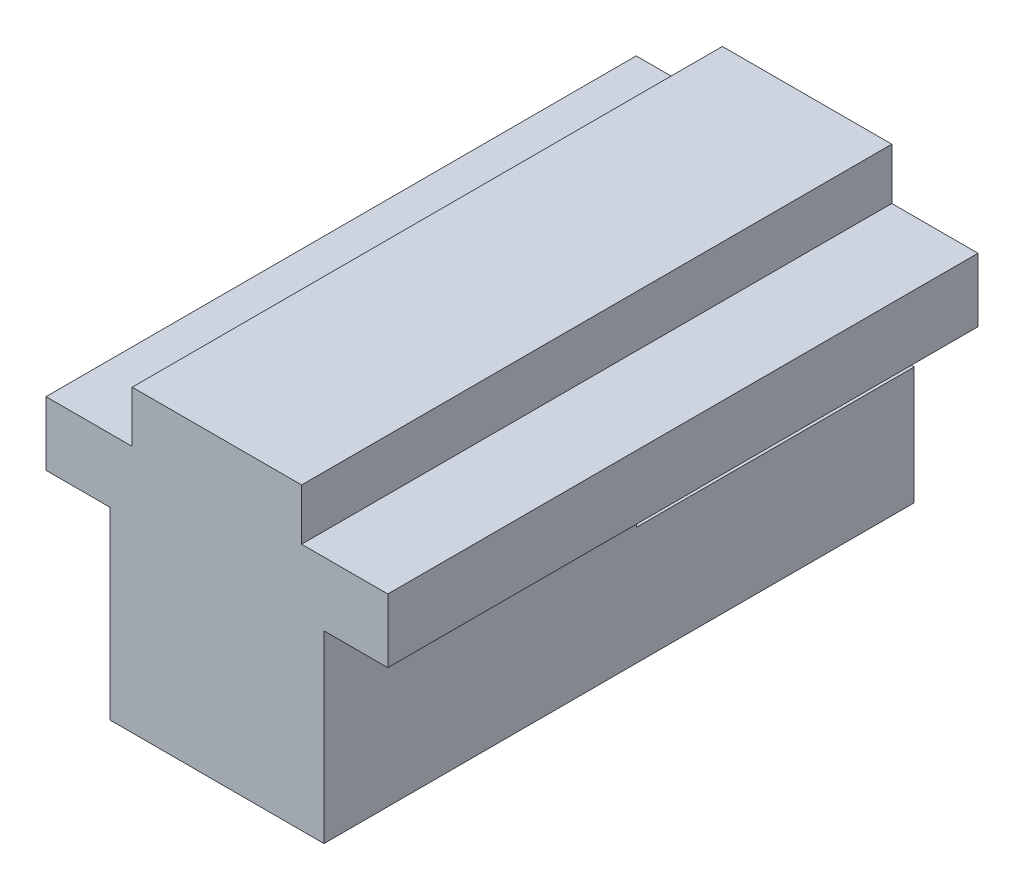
from build123d import *

# Parameters (mm, degrees)
BOSS_EXTRUDE1_DEPTH              = 43.815
SKETCH3_R                        = 1.6002
CUT_EXTRUDE1_DEPTH               = 6.35
F_10_32_TAPPED_HOLE1_D           = 4.0386
F_10_32_TAPPED_HOLE1_DEPTH       = 11.938
F_10_32_TAPPED_HOLE1_CSINK_D     = 6.096
F_10_32_TAPPED_HOLE1_CSINK_ANGLE = 90
F_10_32_TAPPED_HOLE1_TIP         = 1.213317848
CUT_EXTRUDE2_DEPTH               = 51.315979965
CUT_EXTRUDE2_DEPTH_BACK          = 51.315979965
SKETCH6_W                        = 20.6248
SKETCH6_H                        = 4.953


with BuildPart() as part:
    # Sketch2 → Boss-Extrude1 (new body)
    with BuildSketch(Plane.XY):
        Polygon((20.6375, 0), (25.3746, 0), (25.3746, 4.7371), (18.9738, 4.7371), (18.9738, 8.5471), (15.9258, 8.5471), (9.4488, 8.5471), (6.4008, 8.5471), (6.4008, 4.7371), (0, 4.7371), (0, 0), (4.7625, 0), (4.7625, -13.6779), (20.6375, -13.6779), align=None)
    extrude(amount=-BOSS_EXTRUDE1_DEPTH)

    # Sketch3 → Cut-Extrude1 (cut)
    with BuildSketch(Plane.XZ.offset(13.6779)):
        with Locations((7.9375, -12.065)):
            Circle(SKETCH3_R)
        with Locations((17.4625, -12.065)):
            Circle(SKETCH3_R)
    extrude(amount=-CUT_EXTRUDE1_DEPTH, mode=Mode.SUBTRACT)

    # 10-32 Tapped Hole1
    with Locations(Plane(origin=(0, -13.6779, 0), x_dir=(-1, 0, 0), z_dir=(0, -1, 0))):
        with Locations((-12.878007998, 4.1275), (-12.878007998, 20.0025)):
            CounterSinkHole(F_10_32_TAPPED_HOLE1_D / 2, F_10_32_TAPPED_HOLE1_CSINK_D / 2, depth=F_10_32_TAPPED_HOLE1_DEPTH, counter_sink_angle=F_10_32_TAPPED_HOLE1_CSINK_ANGLE)
            with Locations((0, 0, -(F_10_32_TAPPED_HOLE1_DEPTH + F_10_32_TAPPED_HOLE1_TIP / 2))):  # 118° drill point
                Cone(0, F_10_32_TAPPED_HOLE1_D / 2, F_10_32_TAPPED_HOLE1_TIP, mode=Mode.SUBTRACT)

    # Sketch6 → Cut-Extrude2 (cut, two sides: drawn at the far end of the back side and taken through both)
    with BuildSketch(Plane.ZY.offset(-4.7625).offset(-CUT_EXTRUDE2_DEPTH_BACK)):
        with Locations((-33.5026, -2.4638)):
            Rectangle(SKETCH6_W, SKETCH6_H)
    extrude(amount=CUT_EXTRUDE2_DEPTH + CUT_EXTRUDE2_DEPTH_BACK, mode=Mode.SUBTRACT)


solid = part.part
